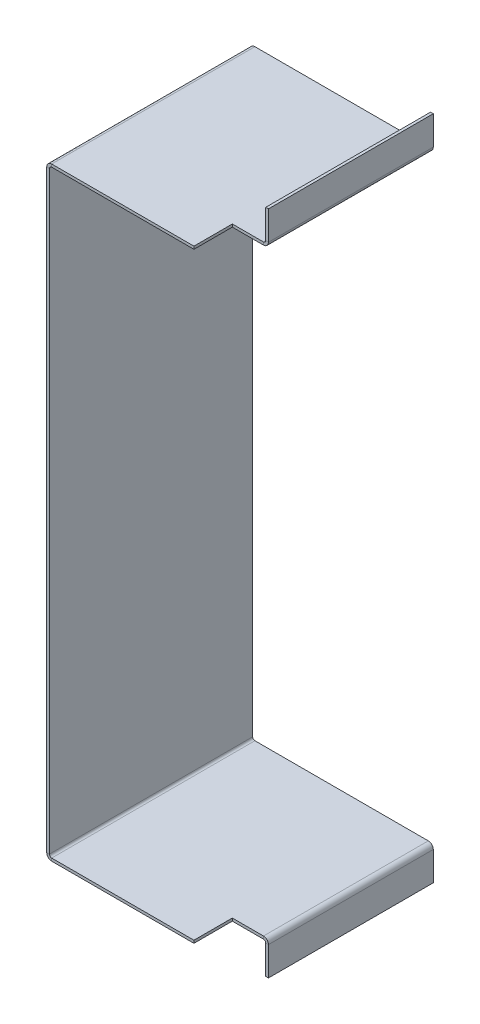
ISO-10303-21;
HEADER;
FILE_DESCRIPTION(('STEP AP214'),'2;1');
FILE_NAME('part.step','',(''),(''),'','','');
FILE_SCHEMA(('AUTOMOTIVE_DESIGN { 1 0 10303 214 1 1 1 1 }'));
ENDSEC;
DATA;
#1=APPLICATION_CONTEXT('core data for automotive mechanical design processes');
#2=APPLICATION_PROTOCOL_DEFINITION('international standard','automotive_design',2000,#1);
#3=PRODUCT_CONTEXT('',#1,'mechanical');
#4=PRODUCT('Part','Part','',(#3));
#5=PRODUCT_RELATED_PRODUCT_CATEGORY('part','',(#4));
#6=PRODUCT_DEFINITION_FORMATION('','',#4);
#7=PRODUCT_DEFINITION_CONTEXT('part definition',#1,'design');
#8=PRODUCT_DEFINITION('design','',#6,#7);
#9=PRODUCT_DEFINITION_SHAPE('','',#8);
#10=(LENGTH_UNIT() NAMED_UNIT(*) SI_UNIT(.MILLI.,.METRE.));
#11=(NAMED_UNIT(*) PLANE_ANGLE_UNIT() SI_UNIT($,.RADIAN.));
#12=(NAMED_UNIT(*) SI_UNIT($,.STERADIAN.) SOLID_ANGLE_UNIT());
#13=UNCERTAINTY_MEASURE_WITH_UNIT(LENGTH_MEASURE(1.E-05),#10,'distance_accuracy_value','');
#14=(GEOMETRIC_REPRESENTATION_CONTEXT(3) GLOBAL_UNCERTAINTY_ASSIGNED_CONTEXT((#13)) GLOBAL_UNIT_ASSIGNED_CONTEXT((#10,
#11,#12)) REPRESENTATION_CONTEXT('',''));
#15=CARTESIAN_POINT('',(0.,0.,0.));
#16=DIRECTION('',(0.,0.,1.));
#17=DIRECTION('',(1.,0.,0.));
#18=AXIS2_PLACEMENT_3D('',#15,#16,#17);
#19=CARTESIAN_POINT('',(0.,-295.,72.9999999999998));
#20=DIRECTION('',(0.,0.,-1.));
#21=DIRECTION('',(-1.,0.,0.));
#22=AXIS2_PLACEMENT_3D('',#19,#20,#21);
#23=PLANE('',#22);
#24=DIRECTION('',(0.,1.,0.));
#25=VECTOR('',#24,1.);
#26=CARTESIAN_POINT('',(-1.19999999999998,0.,73.));
#27=LINE('',#26,#25);
#28=CARTESIAN_POINT('',(-1.19999999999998,-12.7999999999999,72.9999999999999));
#29=VERTEX_POINT('',#28);
#30=CARTESIAN_POINT('',(-1.19999999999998,0.,73.));
#31=VERTEX_POINT('',#30);
#32=EDGE_CURVE('E259',#29,#31,#27,.T.);
#33=ORIENTED_EDGE('',*,*,#32,.F.);
#34=DIRECTION('',(1.,0.,0.));
#35=VECTOR('',#34,1.);
#36=CARTESIAN_POINT('',(-1.19999999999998,-12.7999999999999,72.9999999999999));
#37=LINE('',#36,#35);
#38=CARTESIAN_POINT('',(0.,-12.7999999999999,72.9999999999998));
#39=VERTEX_POINT('',#38);
#40=EDGE_CURVE('E11',#29,#39,#37,.T.);
#41=ORIENTED_EDGE('',*,*,#40,.T.);
#42=DIRECTION('',(0.,1.,0.));
#43=VECTOR('',#42,1.);
#44=CARTESIAN_POINT('',(0.,-295.,72.9999999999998));
#45=LINE('',#44,#43);
#46=CARTESIAN_POINT('',(0.,0.,72.9999999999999));
#47=VERTEX_POINT('',#46);
#48=EDGE_CURVE('E211',#39,#47,#45,.T.);
#49=ORIENTED_EDGE('',*,*,#48,.T.);
#50=DIRECTION('',(-1.,0.,0.));
#51=VECTOR('',#50,1.);
#52=CARTESIAN_POINT('',(0.,0.,72.9999999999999));
#53=LINE('',#52,#51);
#54=EDGE_CURVE('E222',#47,#31,#53,.T.);
#55=ORIENTED_EDGE('',*,*,#54,.T.);
#56=EDGE_LOOP('',(#33,#41,#49,#55));
#57=FACE_BOUND('',#56,.T.);
#58=ADVANCED_FACE('F44',(#57),#23,.F.);
#59=DIRECTION('',(1.,0.,0.));
#60=VECTOR('',#59,1.);
#61=CARTESIAN_POINT('',(0.,-15.,72.9999999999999));
#62=LINE('',#61,#60);
#63=CARTESIAN_POINT('',(-16.,-15.,73.));
#64=VERTEX_POINT('',#63);
#65=CARTESIAN_POINT('',(-2.19999999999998,-15.,73.));
#66=VERTEX_POINT('',#65);
#67=EDGE_CURVE('E265',#64,#66,#62,.T.);
#68=ORIENTED_EDGE('',*,*,#67,.T.);
#69=DIRECTION('',(0.,1.,0.));
#70=VECTOR('',#69,1.);
#71=CARTESIAN_POINT('',(-2.19999999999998,-15.,73.));
#72=LINE('',#71,#70);
#73=CARTESIAN_POINT('',(-2.19999999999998,-13.7999999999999,73.));
#74=VERTEX_POINT('',#73);
#75=EDGE_CURVE('E53',#66,#74,#72,.T.);
#76=ORIENTED_EDGE('',*,*,#75,.T.);
#77=DIRECTION('',(1.,0.,0.));
#78=VECTOR('',#77,1.);
#79=CARTESIAN_POINT('',(0.,-13.7999999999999,72.9999999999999));
#80=LINE('',#79,#78);
#81=CARTESIAN_POINT('',(-16.,-13.7999999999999,73.));
#82=VERTEX_POINT('',#81);
#83=EDGE_CURVE('E253',#82,#74,#80,.T.);
#84=ORIENTED_EDGE('',*,*,#83,.F.);
#85=DIRECTION('',(0.,1.,0.));
#86=VECTOR('',#85,1.);
#87=CARTESIAN_POINT('',(-16.,-295.,72.9999999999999));
#88=LINE('',#87,#86);
#89=EDGE_CURVE('E237',#64,#82,#88,.T.);
#90=ORIENTED_EDGE('',*,*,#89,.F.);
#91=EDGE_LOOP('',(#68,#76,#84,#90));
#92=FACE_BOUND('',#91,.T.);
#93=ADVANCED_FACE('F524',(#92),#23,.F.);
#94=DIRECTION('',(-1.,0.,0.));
#95=VECTOR('',#94,1.);
#96=CARTESIAN_POINT('',(-80.,-281.2,72.9999999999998));
#97=LINE('',#96,#95);
#98=CARTESIAN_POINT('',(-2.19999999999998,-281.2,73.));
#99=VERTEX_POINT('',#98);
#100=CARTESIAN_POINT('',(-16.,-281.2,72.9999999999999));
#101=VERTEX_POINT('',#100);
#102=EDGE_CURVE('E244',#99,#101,#97,.T.);
#103=ORIENTED_EDGE('',*,*,#102,.F.);
#104=DIRECTION('',(0.,1.,0.));
#105=VECTOR('',#104,1.);
#106=CARTESIAN_POINT('',(-2.19999999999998,-281.2,73.));
#107=LINE('',#106,#105);
#108=CARTESIAN_POINT('',(-2.19999999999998,-280.,73.));
#109=VERTEX_POINT('',#108);
#110=EDGE_CURVE('E516',#99,#109,#107,.T.);
#111=ORIENTED_EDGE('',*,*,#110,.T.);
#112=DIRECTION('',(-1.,0.,0.));
#113=VECTOR('',#112,1.);
#114=CARTESIAN_POINT('',(-80.,-280.,73.));
#115=LINE('',#114,#113);
#116=CARTESIAN_POINT('',(-16.,-280.,72.9999999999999));
#117=VERTEX_POINT('',#116);
#118=EDGE_CURVE('E269',#109,#117,#115,.T.);
#119=ORIENTED_EDGE('',*,*,#118,.T.);
#120=EDGE_CURVE('E561',#101,#117,#88,.T.);
#121=ORIENTED_EDGE('',*,*,#120,.F.);
#122=EDGE_LOOP('',(#103,#111,#119,#121));
#123=FACE_BOUND('',#122,.T.);
#124=ADVANCED_FACE('F606',(#123),#23,.F.);
#125=CARTESIAN_POINT('',(0.,-295.,72.9999999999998));
#126=VERTEX_POINT('',#125);
#127=CARTESIAN_POINT('',(0.,-282.2,72.9999999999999));
#128=VERTEX_POINT('',#127);
#129=EDGE_CURVE('E231',#126,#128,#45,.T.);
#130=ORIENTED_EDGE('',*,*,#129,.T.);
#131=DIRECTION('',(-1.,0.,0.));
#132=VECTOR('',#131,1.);
#133=CARTESIAN_POINT('',(0.,-282.2,72.9999999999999));
#134=LINE('',#133,#132);
#135=CARTESIAN_POINT('',(-1.19999999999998,-282.2,73.));
#136=VERTEX_POINT('',#135);
#137=EDGE_CURVE('E512',#128,#136,#134,.T.);
#138=ORIENTED_EDGE('',*,*,#137,.T.);
#139=DIRECTION('',(0.,1.,0.));
#140=VECTOR('',#139,1.);
#141=CARTESIAN_POINT('',(-1.19999999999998,-280.,72.9999999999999));
#142=LINE('',#141,#140);
#143=CARTESIAN_POINT('',(-1.19999999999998,-295.,72.9999999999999));
#144=VERTEX_POINT('',#143);
#145=EDGE_CURVE('E248',#144,#136,#142,.T.);
#146=ORIENTED_EDGE('',*,*,#145,.F.);
#147=DIRECTION('',(-1.,0.,0.));
#148=VECTOR('',#147,1.);
#149=CARTESIAN_POINT('',(0.,-295.,72.9999999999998));
#150=LINE('',#149,#148);
#151=EDGE_CURVE('E228',#126,#144,#150,.T.);
#152=ORIENTED_EDGE('',*,*,#151,.F.);
#153=EDGE_LOOP('',(#130,#138,#146,#152));
#154=FACE_BOUND('',#153,.T.);
#155=ADVANCED_FACE('F626',(#154),#23,.F.);
#156=CARTESIAN_POINT('',(-1.19999999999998,-12.7999999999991,89.9999999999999));
#157=DIRECTION('',(0.,0.,1.));
#158=DIRECTION('',(1.,0.,0.));
#159=AXIS2_PLACEMENT_3D('',#156,#157,#158);
#160=PLANE('',#159);
#161=DIRECTION('',(0.,1.,0.));
#162=VECTOR('',#161,1.);
#163=CARTESIAN_POINT('',(-16.,-295.,89.9999999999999));
#164=LINE('',#163,#162);
#165=CARTESIAN_POINT('',(-16.,-14.9999999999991,90.));
#166=VERTEX_POINT('',#165);
#167=CARTESIAN_POINT('',(-16.,-13.7999999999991,90.));
#168=VERTEX_POINT('',#167);
#169=EDGE_CURVE('E565',#166,#168,#164,.T.);
#170=ORIENTED_EDGE('',*,*,#169,.T.);
#171=DIRECTION('',(-1.,0.,0.));
#172=VECTOR('',#171,1.);
#173=CARTESIAN_POINT('',(0.,-13.7999999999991,89.9999999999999));
#174=LINE('',#173,#172);
#175=CARTESIAN_POINT('',(-79.,-13.7999999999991,90.));
#176=VERTEX_POINT('',#175);
#177=EDGE_CURVE('E308',#168,#176,#174,.T.);
#178=ORIENTED_EDGE('',*,*,#177,.T.);
#179=DIRECTION('',(0.,-1.,0.));
#180=VECTOR('',#179,1.);
#181=CARTESIAN_POINT('',(-79.,-13.7999999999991,90.));
#182=LINE('',#181,#180);
#183=CARTESIAN_POINT('',(-79.,-14.9999999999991,90.));
#184=VERTEX_POINT('',#183);
#185=EDGE_CURVE('E491',#176,#184,#182,.T.);
#186=ORIENTED_EDGE('',*,*,#185,.T.);
#187=DIRECTION('',(-1.,0.,0.));
#188=VECTOR('',#187,1.);
#189=CARTESIAN_POINT('',(0.,-14.9999999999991,89.9999999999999));
#190=LINE('',#189,#188);
#191=EDGE_CURVE('E304',#166,#184,#190,.T.);
#192=ORIENTED_EDGE('',*,*,#191,.F.);
#193=EDGE_LOOP('',(#170,#178,#186,#192));
#194=FACE_BOUND('',#193,.T.);
#195=ADVANCED_FACE('F46',(#194),#160,.T.);
#196=CARTESIAN_POINT('',(0.,-12.8,0.));
#197=DIRECTION('',(0.,0.,-1.));
#198=DIRECTION('',(-1.,0.,0.));
#199=AXIS2_PLACEMENT_3D('',#196,#197,#198);
#200=PLANE('',#199);
#201=DIRECTION('',(-1.,0.,0.));
#202=VECTOR('',#201,1.);
#203=CARTESIAN_POINT('',(0.,-12.8,0.));
#204=LINE('',#203,#202);
#205=CARTESIAN_POINT('',(0.,-12.8,0.));
#206=VERTEX_POINT('',#205);
#207=CARTESIAN_POINT('',(-1.19999999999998,-12.8,0.));
#208=VERTEX_POINT('',#207);
#209=EDGE_CURVE('E503',#206,#208,#204,.T.);
#210=ORIENTED_EDGE('',*,*,#209,.F.);
#211=CARTESIAN_POINT('',(-2.19999999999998,-12.8,0.));
#212=DIRECTION('',(0.,0.,1.));
#213=DIRECTION('',(1.,0.,0.));
#214=AXIS2_PLACEMENT_3D('',#211,#212,#213);
#215=CIRCLE('',#214,2.2);
#216=CARTESIAN_POINT('',(-2.19999999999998,-15.,0.));
#217=VERTEX_POINT('',#216);
#218=EDGE_CURVE('E362',#206,#217,#215,.F.);
#219=ORIENTED_EDGE('',*,*,#218,.T.);
#220=DIRECTION('',(0.,-1.,0.));
#221=VECTOR('',#220,1.);
#222=CARTESIAN_POINT('',(-2.19999999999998,-13.8,0.));
#223=LINE('',#222,#221);
#224=CARTESIAN_POINT('',(-2.19999999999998,-13.8,0.));
#225=VERTEX_POINT('',#224);
#226=EDGE_CURVE('E499',#225,#217,#223,.T.);
#227=ORIENTED_EDGE('',*,*,#226,.F.);
#228=CARTESIAN_POINT('',(-2.19999999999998,-12.8,0.));
#229=DIRECTION('',(0.,0.,1.));
#230=DIRECTION('',(1.,0.,0.));
#231=AXIS2_PLACEMENT_3D('',#228,#229,#230);
#232=CIRCLE('',#231,1.);
#233=EDGE_CURVE('E375',#208,#225,#232,.F.);
#234=ORIENTED_EDGE('',*,*,#233,.F.);
#235=EDGE_LOOP('',(#210,#219,#227,#234));
#236=FACE_BOUND('',#235,.T.);
#237=ADVANCED_FACE('F543',(#236),#200,.T.);
#238=CARTESIAN_POINT('',(-2.19999999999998,-13.8,0.));
#239=DIRECTION('',(0.,0.,-1.));
#240=DIRECTION('',(-1.,0.,0.));
#241=AXIS2_PLACEMENT_3D('',#238,#239,#240);
#242=PLANE('',#241);
#243=DIRECTION('',(0.,-1.,0.));
#244=VECTOR('',#243,1.);
#245=CARTESIAN_POINT('',(0.,0.,0.));
#246=LINE('',#245,#244);
#247=CARTESIAN_POINT('',(0.,0.,0.));
#248=VERTEX_POINT('',#247);
#249=EDGE_CURVE('E213',#248,#206,#246,.T.);
#250=ORIENTED_EDGE('',*,*,#249,.T.);
#251=ORIENTED_EDGE('',*,*,#209,.T.);
#252=DIRECTION('',(0.,-1.,0.));
#253=VECTOR('',#252,1.);
#254=CARTESIAN_POINT('',(-1.19999999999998,0.,0.));
#255=LINE('',#254,#253);
#256=CARTESIAN_POINT('',(-1.19999999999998,0.,0.));
#257=VERTEX_POINT('',#256);
#258=EDGE_CURVE('E371',#257,#208,#255,.T.);
#259=ORIENTED_EDGE('',*,*,#258,.F.);
#260=DIRECTION('',(1.,0.,0.));
#261=VECTOR('',#260,1.);
#262=CARTESIAN_POINT('',(-1.19999999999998,0.,0.));
#263=LINE('',#262,#261);
#264=EDGE_CURVE('E368',#257,#248,#263,.T.);
#265=ORIENTED_EDGE('',*,*,#264,.T.);
#266=EDGE_LOOP('',(#250,#251,#259,#265));
#267=FACE_BOUND('',#266,.T.);
#268=ADVANCED_FACE('F546',(#267),#242,.T.);
#269=CARTESIAN_POINT('',(-80.,-15.9999999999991,89.9999999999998));
#270=DIRECTION('',(0.,0.,1.));
#271=DIRECTION('',(1.,0.,0.));
#272=AXIS2_PLACEMENT_3D('',#269,#270,#271);
#273=PLANE('',#272);
#274=DIRECTION('',(-1.,0.,0.));
#275=VECTOR('',#274,1.);
#276=CARTESIAN_POINT('',(-80.,-15.9999999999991,89.9999999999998));
#277=LINE('',#276,#275);
#278=CARTESIAN_POINT('',(-80.,-15.9999999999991,89.9999999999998));
#279=VERTEX_POINT('',#278);
#280=CARTESIAN_POINT('',(-81.2,-15.9999999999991,89.9999999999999));
#281=VERTEX_POINT('',#280);
#282=EDGE_CURVE('E495',#279,#281,#277,.T.);
#283=ORIENTED_EDGE('',*,*,#282,.F.);
#284=CARTESIAN_POINT('',(-79.,-15.9999999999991,90.));
#285=DIRECTION('',(0.,0.,-1.));
#286=DIRECTION('',(-1.,0.,0.));
#287=AXIS2_PLACEMENT_3D('',#284,#285,#286);
#288=CIRCLE('',#287,1.);
#289=EDGE_CURVE('E300',#184,#279,#288,.F.);
#290=ORIENTED_EDGE('',*,*,#289,.F.);
#291=ORIENTED_EDGE('',*,*,#185,.F.);
#292=CARTESIAN_POINT('',(-79.,-15.9999999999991,90.));
#293=DIRECTION('',(0.,0.,1.));
#294=DIRECTION('',(1.,0.,0.));
#295=AXIS2_PLACEMENT_3D('',#292,#293,#294);
#296=CIRCLE('',#295,2.2);
#297=EDGE_CURVE('E312',#176,#281,#296,.T.);
#298=ORIENTED_EDGE('',*,*,#297,.T.);
#299=EDGE_LOOP('',(#283,#290,#291,#298));
#300=FACE_BOUND('',#299,.T.);
#301=ADVANCED_FACE('F943',(#300),#273,.T.);
#302=CARTESIAN_POINT('',(-79.,-13.7999999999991,90.));
#303=DIRECTION('',(0.,0.,1.));
#304=DIRECTION('',(1.,0.,0.));
#305=AXIS2_PLACEMENT_3D('',#302,#303,#304);
#306=PLANE('',#305);
#307=DIRECTION('',(0.,-1.,0.));
#308=VECTOR('',#307,1.);
#309=CARTESIAN_POINT('',(-80.,-14.9999999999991,89.9999999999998));
#310=LINE('',#309,#308);
#311=CARTESIAN_POINT('',(-80.,-279.,90.));
#312=VERTEX_POINT('',#311);
#313=EDGE_CURVE('E296',#279,#312,#310,.T.);
#314=ORIENTED_EDGE('',*,*,#313,.F.);
#315=ORIENTED_EDGE('',*,*,#282,.T.);
#316=DIRECTION('',(0.,-1.,0.));
#317=VECTOR('',#316,1.);
#318=CARTESIAN_POINT('',(-81.2,-14.9999999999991,89.9999999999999));
#319=LINE('',#318,#317);
#320=CARTESIAN_POINT('',(-81.2,-279.,89.9999999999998));
#321=VERTEX_POINT('',#320);
#322=EDGE_CURVE('E316',#281,#321,#319,.T.);
#323=ORIENTED_EDGE('',*,*,#322,.T.);
#324=DIRECTION('',(1.,0.,0.));
#325=VECTOR('',#324,1.);
#326=CARTESIAN_POINT('',(-81.2,-279.,89.9999999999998));
#327=LINE('',#326,#325);
#328=EDGE_CURVE('E475',#321,#312,#327,.T.);
#329=ORIENTED_EDGE('',*,*,#328,.T.);
#330=EDGE_LOOP('',(#314,#315,#323,#329));
#331=FACE_BOUND('',#330,.T.);
#332=ADVANCED_FACE('F934',(#331),#306,.T.);
#333=CARTESIAN_POINT('',(-79.,-15.,0.));
#334=DIRECTION('',(0.,0.,-1.));
#335=DIRECTION('',(-1.,0.,0.));
#336=AXIS2_PLACEMENT_3D('',#333,#334,#335);
#337=PLANE('',#336);
#338=DIRECTION('',(0.,1.,0.));
#339=VECTOR('',#338,1.);
#340=CARTESIAN_POINT('',(-79.,-15.,0.));
#341=LINE('',#340,#339);
#342=CARTESIAN_POINT('',(-79.,-15.,0.));
#343=VERTEX_POINT('',#342);
#344=CARTESIAN_POINT('',(-79.,-13.8,0.));
#345=VERTEX_POINT('',#344);
#346=EDGE_CURVE('E487',#343,#345,#341,.T.);
#347=ORIENTED_EDGE('',*,*,#346,.F.);
#348=CARTESIAN_POINT('',(-79.,-16.,0.));
#349=DIRECTION('',(0.,0.,-1.));
#350=DIRECTION('',(-1.,0.,0.));
#351=AXIS2_PLACEMENT_3D('',#348,#349,#350);
#352=CIRCLE('',#351,1.);
#353=CARTESIAN_POINT('',(-80.,-16.,0.));
#354=VERTEX_POINT('',#353);
#355=EDGE_CURVE('E354',#343,#354,#352,.F.);
#356=ORIENTED_EDGE('',*,*,#355,.T.);
#357=DIRECTION('',(1.,0.,0.));
#358=VECTOR('',#357,1.);
#359=CARTESIAN_POINT('',(-81.2,-16.,0.));
#360=LINE('',#359,#358);
#361=CARTESIAN_POINT('',(-81.2,-16.,0.));
#362=VERTEX_POINT('',#361);
#363=EDGE_CURVE('E483',#362,#354,#360,.T.);
#364=ORIENTED_EDGE('',*,*,#363,.F.);
#365=CARTESIAN_POINT('',(-79.,-16.,0.));
#366=DIRECTION('',(0.,0.,1.));
#367=DIRECTION('',(1.,0.,0.));
#368=AXIS2_PLACEMENT_3D('',#365,#366,#367);
#369=CIRCLE('',#368,2.2);
#370=EDGE_CURVE('E383',#345,#362,#369,.T.);
#371=ORIENTED_EDGE('',*,*,#370,.F.);
#372=EDGE_LOOP('',(#347,#356,#364,#371));
#373=FACE_BOUND('',#372,.T.);
#374=ADVANCED_FACE('F928',(#373),#337,.T.);
#375=CARTESIAN_POINT('',(-81.2,-16.,0.));
#376=DIRECTION('',(0.,0.,-1.));
#377=DIRECTION('',(-1.,0.,0.));
#378=AXIS2_PLACEMENT_3D('',#375,#376,#377);
#379=PLANE('',#378);
#380=DIRECTION('',(-1.,0.,0.));
#381=VECTOR('',#380,1.);
#382=CARTESIAN_POINT('',(0.,-15.,0.));
#383=LINE('',#382,#381);
#384=EDGE_CURVE('E358',#217,#343,#383,.T.);
#385=ORIENTED_EDGE('',*,*,#384,.T.);
#386=ORIENTED_EDGE('',*,*,#346,.T.);
#387=DIRECTION('',(-1.,0.,0.));
#388=VECTOR('',#387,1.);
#389=CARTESIAN_POINT('',(0.,-13.8,0.));
#390=LINE('',#389,#388);
#391=EDGE_CURVE('E379',#225,#345,#390,.T.);
#392=ORIENTED_EDGE('',*,*,#391,.F.);
#393=ORIENTED_EDGE('',*,*,#226,.T.);
#394=EDGE_LOOP('',(#385,#386,#392,#393));
#395=FACE_BOUND('',#394,.T.);
#396=ADVANCED_FACE('F539',(#395),#379,.T.);
#397=CARTESIAN_POINT('',(-79.,-280.,90.));
#398=DIRECTION('',(0.,0.,1.));
#399=DIRECTION('',(1.,0.,0.));
#400=AXIS2_PLACEMENT_3D('',#397,#398,#399);
#401=PLANE('',#400);
#402=DIRECTION('',(0.,-1.,0.));
#403=VECTOR('',#402,1.);
#404=CARTESIAN_POINT('',(-79.,-280.,90.));
#405=LINE('',#404,#403);
#406=CARTESIAN_POINT('',(-79.,-280.,90.));
#407=VERTEX_POINT('',#406);
#408=CARTESIAN_POINT('',(-79.,-281.2,90.));
#409=VERTEX_POINT('',#408);
#410=EDGE_CURVE('E479',#407,#409,#405,.T.);
#411=ORIENTED_EDGE('',*,*,#410,.F.);
#412=CARTESIAN_POINT('',(-79.,-279.,89.9999999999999));
#413=DIRECTION('',(0.,0.,-1.));
#414=DIRECTION('',(-1.,0.,0.));
#415=AXIS2_PLACEMENT_3D('',#412,#413,#414);
#416=CIRCLE('',#415,1.);
#417=EDGE_CURVE('E291',#312,#407,#416,.F.);
#418=ORIENTED_EDGE('',*,*,#417,.F.);
#419=ORIENTED_EDGE('',*,*,#328,.F.);
#420=CARTESIAN_POINT('',(-79.,-279.,89.9999999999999));
#421=DIRECTION('',(0.,0.,1.));
#422=DIRECTION('',(1.,0.,0.));
#423=AXIS2_PLACEMENT_3D('',#420,#421,#422);
#424=CIRCLE('',#423,2.2);
#425=EDGE_CURVE('E320',#321,#409,#424,.T.);
#426=ORIENTED_EDGE('',*,*,#425,.T.);
#427=EDGE_LOOP('',(#411,#418,#419,#426));
#428=FACE_BOUND('',#427,.T.);
#429=ADVANCED_FACE('F594',(#428),#401,.T.);
#430=CARTESIAN_POINT('',(-81.2,-279.,89.9999999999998));
#431=DIRECTION('',(0.,0.,1.));
#432=DIRECTION('',(1.,0.,0.));
#433=AXIS2_PLACEMENT_3D('',#430,#431,#432);
#434=PLANE('',#433);
#435=CARTESIAN_POINT('',(-16.,-281.2,89.9999999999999));
#436=VERTEX_POINT('',#435);
#437=CARTESIAN_POINT('',(-16.,-280.,89.9999999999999));
#438=VERTEX_POINT('',#437);
#439=EDGE_CURVE('E249',#436,#438,#164,.T.);
#440=ORIENTED_EDGE('',*,*,#439,.T.);
#441=DIRECTION('',(1.,0.,0.));
#442=VECTOR('',#441,1.);
#443=CARTESIAN_POINT('',(-80.,-280.,90.));
#444=LINE('',#443,#442);
#445=EDGE_CURVE('E287',#407,#438,#444,.T.);
#446=ORIENTED_EDGE('',*,*,#445,.F.);
#447=ORIENTED_EDGE('',*,*,#410,.T.);
#448=DIRECTION('',(1.,0.,0.));
#449=VECTOR('',#448,1.);
#450=CARTESIAN_POINT('',(-80.,-281.2,89.9999999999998));
#451=LINE('',#450,#449);
#452=EDGE_CURVE('E324',#409,#436,#451,.T.);
#453=ORIENTED_EDGE('',*,*,#452,.T.);
#454=EDGE_LOOP('',(#440,#446,#447,#453));
#455=FACE_BOUND('',#454,.T.);
#456=ADVANCED_FACE('F579',(#455),#434,.T.);
#457=CARTESIAN_POINT('',(-80.,-279.,0.));
#458=DIRECTION('',(0.,0.,-1.));
#459=DIRECTION('',(-1.,0.,0.));
#460=AXIS2_PLACEMENT_3D('',#457,#458,#459);
#461=PLANE('',#460);
#462=DIRECTION('',(-1.,0.,0.));
#463=VECTOR('',#462,1.);
#464=CARTESIAN_POINT('',(-80.,-279.,0.));
#465=LINE('',#464,#463);
#466=CARTESIAN_POINT('',(-80.,-279.,0.));
#467=VERTEX_POINT('',#466);
#468=CARTESIAN_POINT('',(-81.2,-279.,0.));
#469=VERTEX_POINT('',#468);
#470=EDGE_CURVE('E471',#467,#469,#465,.T.);
#471=ORIENTED_EDGE('',*,*,#470,.F.);
#472=CARTESIAN_POINT('',(-79.,-279.,0.));
#473=DIRECTION('',(0.,0.,-1.));
#474=DIRECTION('',(-1.,0.,0.));
#475=AXIS2_PLACEMENT_3D('',#472,#473,#474);
#476=CIRCLE('',#475,1.);
#477=CARTESIAN_POINT('',(-79.,-280.,0.));
#478=VERTEX_POINT('',#477);
#479=EDGE_CURVE('E346',#467,#478,#476,.F.);
#480=ORIENTED_EDGE('',*,*,#479,.T.);
#481=DIRECTION('',(0.,1.,0.));
#482=VECTOR('',#481,1.);
#483=CARTESIAN_POINT('',(-79.,-281.2,0.));
#484=LINE('',#483,#482);
#485=CARTESIAN_POINT('',(-79.,-281.2,0.));
#486=VERTEX_POINT('',#485);
#487=EDGE_CURVE('E467',#486,#478,#484,.T.);
#488=ORIENTED_EDGE('',*,*,#487,.F.);
#489=CARTESIAN_POINT('',(-79.,-279.,0.));
#490=DIRECTION('',(0.,0.,1.));
#491=DIRECTION('',(1.,0.,0.));
#492=AXIS2_PLACEMENT_3D('',#489,#490,#491);
#493=CIRCLE('',#492,2.2);
#494=EDGE_CURVE('E391',#469,#486,#493,.T.);
#495=ORIENTED_EDGE('',*,*,#494,.F.);
#496=EDGE_LOOP('',(#471,#480,#488,#495));
#497=FACE_BOUND('',#496,.T.);
#498=ADVANCED_FACE('F902',(#497),#461,.T.);
#499=CARTESIAN_POINT('',(-79.,-281.2,0.));
#500=DIRECTION('',(0.,0.,-1.));
#501=DIRECTION('',(-1.,0.,0.));
#502=AXIS2_PLACEMENT_3D('',#499,#500,#501);
#503=PLANE('',#502);
#504=DIRECTION('',(0.,-1.,0.));
#505=VECTOR('',#504,1.);
#506=CARTESIAN_POINT('',(-80.,-15.,0.));
#507=LINE('',#506,#505);
#508=EDGE_CURVE('E350',#354,#467,#507,.T.);
#509=ORIENTED_EDGE('',*,*,#508,.T.);
#510=ORIENTED_EDGE('',*,*,#470,.T.);
#511=DIRECTION('',(0.,-1.,0.));
#512=VECTOR('',#511,1.);
#513=CARTESIAN_POINT('',(-81.2,-15.,0.));
#514=LINE('',#513,#512);
#515=EDGE_CURVE('E387',#362,#469,#514,.T.);
#516=ORIENTED_EDGE('',*,*,#515,.F.);
#517=ORIENTED_EDGE('',*,*,#363,.T.);
#518=EDGE_LOOP('',(#509,#510,#516,#517));
#519=FACE_BOUND('',#518,.T.);
#520=ADVANCED_FACE('F894',(#519),#503,.T.);
#521=CARTESIAN_POINT('',(-2.19999999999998,-280.,0.));
#522=DIRECTION('',(0.,0.,-1.));
#523=DIRECTION('',(-1.,0.,0.));
#524=AXIS2_PLACEMENT_3D('',#521,#522,#523);
#525=PLANE('',#524);
#526=DIRECTION('',(0.,-1.,0.));
#527=VECTOR('',#526,1.);
#528=CARTESIAN_POINT('',(-2.19999999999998,-280.,0.));
#529=LINE('',#528,#527);
#530=CARTESIAN_POINT('',(-2.19999999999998,-280.,0.));
#531=VERTEX_POINT('',#530);
#532=CARTESIAN_POINT('',(-2.19999999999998,-281.2,0.));
#533=VERTEX_POINT('',#532);
#534=EDGE_CURVE('E463',#531,#533,#529,.T.);
#535=ORIENTED_EDGE('',*,*,#534,.F.);
#536=CARTESIAN_POINT('',(-2.19999999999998,-282.2,0.));
#537=DIRECTION('',(0.,0.,1.));
#538=DIRECTION('',(1.,0.,0.));
#539=AXIS2_PLACEMENT_3D('',#536,#537,#538);
#540=CIRCLE('',#539,2.2);
#541=CARTESIAN_POINT('',(0.,-282.2,0.));
#542=VERTEX_POINT('',#541);
#543=EDGE_CURVE('E338',#531,#542,#540,.F.);
#544=ORIENTED_EDGE('',*,*,#543,.T.);
#545=DIRECTION('',(1.,0.,0.));
#546=VECTOR('',#545,1.);
#547=CARTESIAN_POINT('',(-1.19999999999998,-282.2,0.));
#548=LINE('',#547,#546);
#549=CARTESIAN_POINT('',(-1.19999999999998,-282.2,0.));
#550=VERTEX_POINT('',#549);
#551=EDGE_CURVE('E459',#550,#542,#548,.T.);
#552=ORIENTED_EDGE('',*,*,#551,.F.);
#553=CARTESIAN_POINT('',(-2.19999999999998,-282.2,0.));
#554=DIRECTION('',(0.,0.,1.));
#555=DIRECTION('',(1.,0.,0.));
#556=AXIS2_PLACEMENT_3D('',#553,#554,#555);
#557=CIRCLE('',#556,1.);
#558=EDGE_CURVE('E292',#533,#550,#557,.F.);
#559=ORIENTED_EDGE('',*,*,#558,.F.);
#560=EDGE_LOOP('',(#535,#544,#552,#559));
#561=FACE_BOUND('',#560,.T.);
#562=ADVANCED_FACE('F618',(#561),#525,.T.);
#563=CARTESIAN_POINT('',(-1.19999999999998,-282.2,0.));
#564=DIRECTION('',(0.,0.,-1.));
#565=DIRECTION('',(-1.,0.,0.));
#566=AXIS2_PLACEMENT_3D('',#563,#564,#565);
#567=PLANE('',#566);
#568=DIRECTION('',(1.,0.,0.));
#569=VECTOR('',#568,1.);
#570=CARTESIAN_POINT('',(-80.,-280.,0.));
#571=LINE('',#570,#569);
#572=EDGE_CURVE('E342',#478,#531,#571,.T.);
#573=ORIENTED_EDGE('',*,*,#572,.T.);
#574=ORIENTED_EDGE('',*,*,#534,.T.);
#575=DIRECTION('',(1.,0.,0.));
#576=VECTOR('',#575,1.);
#577=CARTESIAN_POINT('',(-80.,-281.2,0.));
#578=LINE('',#577,#576);
#579=EDGE_CURVE('E395',#486,#533,#578,.T.);
#580=ORIENTED_EDGE('',*,*,#579,.F.);
#581=ORIENTED_EDGE('',*,*,#487,.T.);
#582=EDGE_LOOP('',(#573,#574,#580,#581));
#583=FACE_BOUND('',#582,.T.);
#584=ADVANCED_FACE('F610',(#583),#567,.T.);
#585=CARTESIAN_POINT('',(-1.19999999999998,-280.,89.9999999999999));
#586=DIRECTION('',(1.,0.,0.));
#587=DIRECTION('',(0.,1.,0.));
#588=AXIS2_PLACEMENT_3D('',#585,#586,#587);
#589=PLANE('',#588);
#590=DIRECTION('',(0.,0.,-1.));
#591=VECTOR('',#590,1.);
#592=CARTESIAN_POINT('',(-1.19999999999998,-295.,89.9999999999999));
#593=LINE('',#592,#591);
#594=CARTESIAN_POINT('',(-1.19999999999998,-295.,0.));
#595=VERTEX_POINT('',#594);
#596=EDGE_CURVE('E455',#144,#595,#593,.T.);
#597=ORIENTED_EDGE('',*,*,#596,.F.);
#598=ORIENTED_EDGE('',*,*,#145,.T.);
#599=DIRECTION('',(0.,0.,-1.));
#600=VECTOR('',#599,1.);
#601=CARTESIAN_POINT('',(-1.19999999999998,-282.2,90.));
#602=LINE('',#601,#600);
#603=EDGE_CURVE('E328',#136,#550,#602,.T.);
#604=ORIENTED_EDGE('',*,*,#603,.T.);
#605=DIRECTION('',(0.,-1.,0.));
#606=VECTOR('',#605,1.);
#607=CARTESIAN_POINT('',(-1.19999999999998,-280.,0.));
#608=LINE('',#607,#606);
#609=EDGE_CURVE('E286',#550,#595,#608,.T.);
#610=ORIENTED_EDGE('',*,*,#609,.T.);
#611=EDGE_LOOP('',(#597,#598,#604,#610));
#612=FACE_BOUND('',#611,.T.);
#613=ADVANCED_FACE('F622',(#612),#589,.F.);
#614=CARTESIAN_POINT('',(0.,-295.,89.9999999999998));
#615=DIRECTION('',(0.,-1.,0.));
#616=DIRECTION('',(0.,0.,-1.));
#617=AXIS2_PLACEMENT_3D('',#614,#615,#616);
#618=PLANE('',#617);
#619=ORIENTED_EDGE('',*,*,#151,.T.);
#620=ORIENTED_EDGE('',*,*,#596,.T.);
#621=DIRECTION('',(-1.,0.,0.));
#622=VECTOR('',#621,1.);
#623=CARTESIAN_POINT('',(0.,-295.,0.));
#624=LINE('',#623,#622);
#625=CARTESIAN_POINT('',(0.,-295.,0.));
#626=VERTEX_POINT('',#625);
#627=EDGE_CURVE('E332',#626,#595,#624,.T.);
#628=ORIENTED_EDGE('',*,*,#627,.F.);
#629=DIRECTION('',(0.,0.,-1.));
#630=VECTOR('',#629,1.);
#631=CARTESIAN_POINT('',(0.,-295.,89.9999999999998));
#632=LINE('',#631,#630);
#633=EDGE_CURVE('E451',#126,#626,#632,.T.);
#634=ORIENTED_EDGE('',*,*,#633,.F.);
#635=EDGE_LOOP('',(#619,#620,#628,#634));
#636=FACE_BOUND('',#635,.T.);
#637=ADVANCED_FACE('F636',(#636),#618,.T.);
#638=CARTESIAN_POINT('',(0.,-280.,89.9999999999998));
#639=DIRECTION('',(1.,0.,0.));
#640=DIRECTION('',(0.,1.,0.));
#641=AXIS2_PLACEMENT_3D('',#638,#639,#640);
#642=PLANE('',#641);
#643=ORIENTED_EDGE('',*,*,#129,.F.);
#644=ORIENTED_EDGE('',*,*,#633,.T.);
#645=DIRECTION('',(0.,-1.,0.));
#646=VECTOR('',#645,1.);
#647=CARTESIAN_POINT('',(0.,-280.,0.));
#648=LINE('',#647,#646);
#649=EDGE_CURVE('E335',#542,#626,#648,.T.);
#650=ORIENTED_EDGE('',*,*,#649,.F.);
#651=DIRECTION('',(0.,0.,-1.));
#652=VECTOR('',#651,1.);
#653=CARTESIAN_POINT('',(0.,-282.2,89.9999999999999));
#654=LINE('',#653,#652);
#655=EDGE_CURVE('E448',#128,#542,#654,.T.);
#656=ORIENTED_EDGE('',*,*,#655,.F.);
#657=EDGE_LOOP('',(#643,#644,#650,#656));
#658=FACE_BOUND('',#657,.T.);
#659=ADVANCED_FACE('F631',(#658),#642,.T.);
#660=CARTESIAN_POINT('',(-2.19999999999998,-282.2,90.));
#661=DIRECTION('',(0.,0.,-1.));
#662=DIRECTION('',(-1.,0.,0.));
#663=AXIS2_PLACEMENT_3D('',#660,#661,#662);
#664=CYLINDRICAL_SURFACE('',#663,2.2);
#665=CARTESIAN_POINT('',(-2.19999999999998,-282.2,73.));
#666=DIRECTION('',(0.,0.,-1.));
#667=DIRECTION('',(-1.,0.,0.));
#668=AXIS2_PLACEMENT_3D('',#665,#666,#667);
#669=CIRCLE('',#668,2.2);
#670=EDGE_CURVE('E273',#128,#109,#669,.F.);
#671=ORIENTED_EDGE('',*,*,#670,.F.);
#672=ORIENTED_EDGE('',*,*,#655,.T.);
#673=ORIENTED_EDGE('',*,*,#543,.F.);
#674=DIRECTION('',(0.,0.,-1.));
#675=VECTOR('',#674,1.);
#676=CARTESIAN_POINT('',(-2.19999999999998,-280.,90.));
#677=LINE('',#676,#675);
#678=EDGE_CURVE('E445',#109,#531,#677,.T.);
#679=ORIENTED_EDGE('',*,*,#678,.F.);
#680=EDGE_LOOP('',(#671,#672,#673,#679));
#681=FACE_BOUND('',#680,.T.);
#682=ADVANCED_FACE('F612',(#681),#664,.T.);
#683=CARTESIAN_POINT('',(-80.,-280.,90.));
#684=DIRECTION('',(0.,1.,0.));
#685=DIRECTION('',(0.,0.,1.));
#686=AXIS2_PLACEMENT_3D('',#683,#684,#685);
#687=PLANE('',#686);
#688=DIRECTION('',(0.,0.,1.));
#689=VECTOR('',#688,1.);
#690=CARTESIAN_POINT('',(-16.,-280.,89.9999999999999));
#691=LINE('',#690,#689);
#692=EDGE_CURVE('E283',#117,#438,#691,.T.);
#693=ORIENTED_EDGE('',*,*,#692,.F.);
#694=ORIENTED_EDGE('',*,*,#118,.F.);
#695=ORIENTED_EDGE('',*,*,#678,.T.);
#696=ORIENTED_EDGE('',*,*,#572,.F.);
#697=DIRECTION('',(0.,0.,-1.));
#698=VECTOR('',#697,1.);
#699=CARTESIAN_POINT('',(-79.,-280.,90.));
#700=LINE('',#699,#698);
#701=EDGE_CURVE('E442',#407,#478,#700,.T.);
#702=ORIENTED_EDGE('',*,*,#701,.F.);
#703=ORIENTED_EDGE('',*,*,#445,.T.);
#704=EDGE_LOOP('',(#693,#694,#695,#696,#702,#703));
#705=FACE_BOUND('',#704,.T.);
#706=ADVANCED_FACE('F584',(#705),#687,.T.);
#707=CARTESIAN_POINT('',(-79.,-279.,89.9999999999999));
#708=DIRECTION('',(0.,0.,-1.));
#709=DIRECTION('',(-1.,0.,0.));
#710=AXIS2_PLACEMENT_3D('',#707,#708,#709);
#711=CYLINDRICAL_SURFACE('',#710,1.);
#712=ORIENTED_EDGE('',*,*,#479,.F.);
#713=DIRECTION('',(0.,0.,-1.));
#714=VECTOR('',#713,1.);
#715=CARTESIAN_POINT('',(-80.,-279.,90.));
#716=LINE('',#715,#714);
#717=EDGE_CURVE('E439',#312,#467,#716,.T.);
#718=ORIENTED_EDGE('',*,*,#717,.F.);
#719=ORIENTED_EDGE('',*,*,#417,.T.);
#720=ORIENTED_EDGE('',*,*,#701,.T.);
#721=EDGE_LOOP('',(#712,#718,#719,#720));
#722=FACE_BOUND('',#721,.T.);
#723=ADVANCED_FACE('F588',(#722),#711,.F.);
#724=CARTESIAN_POINT('',(-80.,-14.9999999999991,89.9999999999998));
#725=DIRECTION('',(1.,0.,0.));
#726=DIRECTION('',(0.,1.,0.));
#727=AXIS2_PLACEMENT_3D('',#724,#725,#726);
#728=PLANE('',#727);
#729=ORIENTED_EDGE('',*,*,#508,.F.);
#730=DIRECTION('',(0.,0.,-1.));
#731=VECTOR('',#730,1.);
#732=CARTESIAN_POINT('',(-80.,-15.9999999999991,89.9999999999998));
#733=LINE('',#732,#731);
#734=EDGE_CURVE('E436',#279,#354,#733,.T.);
#735=ORIENTED_EDGE('',*,*,#734,.F.);
#736=ORIENTED_EDGE('',*,*,#313,.T.);
#737=ORIENTED_EDGE('',*,*,#717,.T.);
#738=EDGE_LOOP('',(#729,#735,#736,#737));
#739=FACE_BOUND('',#738,.T.);
#740=ADVANCED_FACE('F816',(#739),#728,.T.);
#741=CARTESIAN_POINT('',(-79.,-15.9999999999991,90.));
#742=DIRECTION('',(0.,0.,-1.));
#743=DIRECTION('',(-1.,0.,0.));
#744=AXIS2_PLACEMENT_3D('',#741,#742,#743);
#745=CYLINDRICAL_SURFACE('',#744,1.);
#746=ORIENTED_EDGE('',*,*,#355,.F.);
#747=DIRECTION('',(0.,0.,-1.));
#748=VECTOR('',#747,1.);
#749=CARTESIAN_POINT('',(-79.,-14.9999999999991,90.));
#750=LINE('',#749,#748);
#751=EDGE_CURVE('E433',#184,#343,#750,.T.);
#752=ORIENTED_EDGE('',*,*,#751,.F.);
#753=ORIENTED_EDGE('',*,*,#289,.T.);
#754=ORIENTED_EDGE('',*,*,#734,.T.);
#755=EDGE_LOOP('',(#746,#752,#753,#754));
#756=FACE_BOUND('',#755,.T.);
#757=ADVANCED_FACE('F805',(#756),#745,.F.);
#758=CARTESIAN_POINT('',(0.,-14.9999999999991,89.9999999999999));
#759=DIRECTION('',(0.,-1.,0.));
#760=DIRECTION('',(1.,0.,0.));
#761=AXIS2_PLACEMENT_3D('',#758,#759,#760);
#762=PLANE('',#761);
#763=DIRECTION('',(0.,0.,-1.));
#764=VECTOR('',#763,1.);
#765=CARTESIAN_POINT('',(-16.,-14.9999999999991,90.));
#766=LINE('',#765,#764);
#767=EDGE_CURVE('E280',#166,#64,#766,.T.);
#768=ORIENTED_EDGE('',*,*,#767,.F.);
#769=ORIENTED_EDGE('',*,*,#191,.T.);
#770=ORIENTED_EDGE('',*,*,#751,.T.);
#771=ORIENTED_EDGE('',*,*,#384,.F.);
#772=DIRECTION('',(0.,0.,-1.));
#773=VECTOR('',#772,1.);
#774=CARTESIAN_POINT('',(-2.19999999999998,-14.9999999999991,90.));
#775=LINE('',#774,#773);
#776=EDGE_CURVE('E430',#66,#217,#775,.T.);
#777=ORIENTED_EDGE('',*,*,#776,.F.);
#778=ORIENTED_EDGE('',*,*,#67,.F.);
#779=EDGE_LOOP('',(#768,#769,#770,#771,#777,#778));
#780=FACE_BOUND('',#779,.T.);
#781=ADVANCED_FACE('F534',(#780),#762,.T.);
#782=CARTESIAN_POINT('',(-2.19999999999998,-12.7999999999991,90.));
#783=DIRECTION('',(0.,0.,-1.));
#784=DIRECTION('',(-1.,0.,0.));
#785=AXIS2_PLACEMENT_3D('',#782,#783,#784);
#786=CYLINDRICAL_SURFACE('',#785,2.2);
#787=CARTESIAN_POINT('',(-2.19999999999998,-12.7999999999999,73.));
#788=DIRECTION('',(0.,0.,-1.));
#789=DIRECTION('',(-1.,0.,0.));
#790=AXIS2_PLACEMENT_3D('',#787,#788,#789);
#791=CIRCLE('',#790,2.2);
#792=EDGE_CURVE('E262',#66,#39,#791,.F.);
#793=ORIENTED_EDGE('',*,*,#792,.F.);
#794=ORIENTED_EDGE('',*,*,#776,.T.);
#795=ORIENTED_EDGE('',*,*,#218,.F.);
#796=DIRECTION('',(0.,0.,-1.));
#797=VECTOR('',#796,1.);
#798=CARTESIAN_POINT('',(0.,-12.7999999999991,89.9999999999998));
#799=LINE('',#798,#797);
#800=EDGE_CURVE('E218',#39,#206,#799,.T.);
#801=ORIENTED_EDGE('',*,*,#800,.F.);
#802=EDGE_LOOP('',(#793,#794,#795,#801));
#803=FACE_BOUND('',#802,.T.);
#804=ADVANCED_FACE('F530',(#803),#786,.T.);
#805=CARTESIAN_POINT('',(0.,0.,89.9999999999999));
#806=DIRECTION('',(1.,0.,0.));
#807=DIRECTION('',(0.,1.,0.));
#808=AXIS2_PLACEMENT_3D('',#805,#806,#807);
#809=PLANE('',#808);
#810=ORIENTED_EDGE('',*,*,#48,.F.);
#811=ORIENTED_EDGE('',*,*,#800,.T.);
#812=ORIENTED_EDGE('',*,*,#249,.F.);
#813=DIRECTION('',(0.,0.,-1.));
#814=VECTOR('',#813,1.);
#815=CARTESIAN_POINT('',(0.,0.,89.9999999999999));
#816=LINE('',#815,#814);
#817=EDGE_CURVE('E207',#47,#248,#816,.T.);
#818=ORIENTED_EDGE('',*,*,#817,.F.);
#819=EDGE_LOOP('',(#810,#811,#812,#818));
#820=FACE_BOUND('',#819,.T.);
#821=ADVANCED_FACE('F209',(#820),#809,.T.);
#822=CARTESIAN_POINT('',(-1.20000000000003,0.,90.));
#823=DIRECTION('',(0.,1.,0.));
#824=DIRECTION('',(-1.,0.,0.));
#825=AXIS2_PLACEMENT_3D('',#822,#823,#824);
#826=PLANE('',#825);
#827=ORIENTED_EDGE('',*,*,#54,.F.);
#828=ORIENTED_EDGE('',*,*,#817,.T.);
#829=ORIENTED_EDGE('',*,*,#264,.F.);
#830=DIRECTION('',(0.,0.,-1.));
#831=VECTOR('',#830,1.);
#832=CARTESIAN_POINT('',(-1.20000000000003,0.,90.));
#833=LINE('',#832,#831);
#834=EDGE_CURVE('E219',#31,#257,#833,.T.);
#835=ORIENTED_EDGE('',*,*,#834,.F.);
#836=EDGE_LOOP('',(#827,#828,#829,#835));
#837=FACE_BOUND('',#836,.T.);
#838=ADVANCED_FACE('F223',(#837),#826,.T.);
#839=CARTESIAN_POINT('',(-1.20000000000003,0.,90.));
#840=DIRECTION('',(1.,0.,0.));
#841=DIRECTION('',(0.,1.,0.));
#842=AXIS2_PLACEMENT_3D('',#839,#840,#841);
#843=PLANE('',#842);
#844=DIRECTION('',(0.,0.,-1.));
#845=VECTOR('',#844,1.);
#846=CARTESIAN_POINT('',(-1.19999999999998,-12.7999999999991,89.9999999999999));
#847=LINE('',#846,#845);
#848=EDGE_CURVE('E423',#29,#208,#847,.T.);
#849=ORIENTED_EDGE('',*,*,#848,.F.);
#850=ORIENTED_EDGE('',*,*,#32,.T.);
#851=ORIENTED_EDGE('',*,*,#834,.T.);
#852=ORIENTED_EDGE('',*,*,#258,.T.);
#853=EDGE_LOOP('',(#849,#850,#851,#852));
#854=FACE_BOUND('',#853,.T.);
#855=ADVANCED_FACE('F549',(#854),#843,.F.);
#856=CARTESIAN_POINT('',(-2.19999999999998,-12.7999999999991,90.));
#857=DIRECTION('',(0.,0.,-1.));
#858=DIRECTION('',(-1.,0.,0.));
#859=AXIS2_PLACEMENT_3D('',#856,#857,#858);
#860=CYLINDRICAL_SURFACE('',#859,1.);
#861=DIRECTION('',(0.,0.,-1.));
#862=VECTOR('',#861,1.);
#863=CARTESIAN_POINT('',(-2.19999999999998,-13.7999999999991,90.));
#864=LINE('',#863,#862);
#865=EDGE_CURVE('E420',#74,#225,#864,.T.);
#866=ORIENTED_EDGE('',*,*,#865,.F.);
#867=CARTESIAN_POINT('',(-2.19999999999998,-12.7999999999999,73.));
#868=DIRECTION('',(0.,0.,-1.));
#869=DIRECTION('',(-1.,0.,0.));
#870=AXIS2_PLACEMENT_3D('',#867,#868,#869);
#871=CIRCLE('',#870,1.);
#872=EDGE_CURVE('E60',#74,#29,#871,.F.);
#873=ORIENTED_EDGE('',*,*,#872,.T.);
#874=ORIENTED_EDGE('',*,*,#848,.T.);
#875=ORIENTED_EDGE('',*,*,#233,.T.);
#876=EDGE_LOOP('',(#866,#873,#874,#875));
#877=FACE_BOUND('',#876,.T.);
#878=ADVANCED_FACE('F551',(#877),#860,.F.);
#879=CARTESIAN_POINT('',(0.,-13.7999999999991,89.9999999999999));
#880=DIRECTION('',(0.,-1.,0.));
#881=DIRECTION('',(1.,0.,0.));
#882=AXIS2_PLACEMENT_3D('',#879,#880,#881);
#883=PLANE('',#882);
#884=ORIENTED_EDGE('',*,*,#177,.F.);
#885=DIRECTION('',(0.,0.,-1.));
#886=VECTOR('',#885,1.);
#887=CARTESIAN_POINT('',(-16.,-13.7999999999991,90.));
#888=LINE('',#887,#886);
#889=EDGE_CURVE('E277',#168,#82,#888,.T.);
#890=ORIENTED_EDGE('',*,*,#889,.T.);
#891=ORIENTED_EDGE('',*,*,#83,.T.);
#892=ORIENTED_EDGE('',*,*,#865,.T.);
#893=ORIENTED_EDGE('',*,*,#391,.T.);
#894=DIRECTION('',(0.,0.,-1.));
#895=VECTOR('',#894,1.);
#896=CARTESIAN_POINT('',(-79.,-13.7999999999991,90.));
#897=LINE('',#896,#895);
#898=EDGE_CURVE('E417',#176,#345,#897,.T.);
#899=ORIENTED_EDGE('',*,*,#898,.F.);
#900=EDGE_LOOP('',(#884,#890,#891,#892,#893,#899));
#901=FACE_BOUND('',#900,.T.);
#902=ADVANCED_FACE('F554',(#901),#883,.F.);
#903=CARTESIAN_POINT('',(-79.,-15.9999999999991,90.));
#904=DIRECTION('',(0.,0.,-1.));
#905=DIRECTION('',(-1.,0.,0.));
#906=AXIS2_PLACEMENT_3D('',#903,#904,#905);
#907=CYLINDRICAL_SURFACE('',#906,2.2);
#908=ORIENTED_EDGE('',*,*,#370,.T.);
#909=DIRECTION('',(0.,0.,-1.));
#910=VECTOR('',#909,1.);
#911=CARTESIAN_POINT('',(-81.2,-15.9999999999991,89.9999999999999));
#912=LINE('',#911,#910);
#913=EDGE_CURVE('E414',#281,#362,#912,.T.);
#914=ORIENTED_EDGE('',*,*,#913,.F.);
#915=ORIENTED_EDGE('',*,*,#297,.F.);
#916=ORIENTED_EDGE('',*,*,#898,.T.);
#917=EDGE_LOOP('',(#908,#914,#915,#916));
#918=FACE_BOUND('',#917,.T.);
#919=ADVANCED_FACE('F722',(#918),#907,.T.);
#920=CARTESIAN_POINT('',(-81.2,-14.9999999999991,89.9999999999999));
#921=DIRECTION('',(1.,0.,0.));
#922=DIRECTION('',(0.,1.,0.));
#923=AXIS2_PLACEMENT_3D('',#920,#921,#922);
#924=PLANE('',#923);
#925=ORIENTED_EDGE('',*,*,#515,.T.);
#926=DIRECTION('',(0.,0.,-1.));
#927=VECTOR('',#926,1.);
#928=CARTESIAN_POINT('',(-81.2,-279.,89.9999999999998));
#929=LINE('',#928,#927);
#930=EDGE_CURVE('E411',#321,#469,#929,.T.);
#931=ORIENTED_EDGE('',*,*,#930,.F.);
#932=ORIENTED_EDGE('',*,*,#322,.F.);
#933=ORIENTED_EDGE('',*,*,#913,.T.);
#934=EDGE_LOOP('',(#925,#931,#932,#933));
#935=FACE_BOUND('',#934,.T.);
#936=ADVANCED_FACE('F711',(#935),#924,.F.);
#937=CARTESIAN_POINT('',(-79.,-279.,89.9999999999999));
#938=DIRECTION('',(0.,0.,-1.));
#939=DIRECTION('',(-1.,0.,0.));
#940=AXIS2_PLACEMENT_3D('',#937,#938,#939);
#941=CYLINDRICAL_SURFACE('',#940,2.2);
#942=ORIENTED_EDGE('',*,*,#494,.T.);
#943=DIRECTION('',(0.,0.,-1.));
#944=VECTOR('',#943,1.);
#945=CARTESIAN_POINT('',(-79.,-281.2,90.));
#946=LINE('',#945,#944);
#947=EDGE_CURVE('E408',#409,#486,#946,.T.);
#948=ORIENTED_EDGE('',*,*,#947,.F.);
#949=ORIENTED_EDGE('',*,*,#425,.F.);
#950=ORIENTED_EDGE('',*,*,#930,.T.);
#951=EDGE_LOOP('',(#942,#948,#949,#950));
#952=FACE_BOUND('',#951,.T.);
#953=ADVANCED_FACE('F597',(#952),#941,.T.);
#954=CARTESIAN_POINT('',(-80.,-281.2,89.9999999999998));
#955=DIRECTION('',(0.,1.,0.));
#956=DIRECTION('',(0.,0.,1.));
#957=AXIS2_PLACEMENT_3D('',#954,#955,#956);
#958=PLANE('',#957);
#959=ORIENTED_EDGE('',*,*,#102,.T.);
#960=DIRECTION('',(0.,0.,1.));
#961=VECTOR('',#960,1.);
#962=CARTESIAN_POINT('',(-16.,-281.2,89.9999999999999));
#963=LINE('',#962,#961);
#964=EDGE_CURVE('E509',#101,#436,#963,.T.);
#965=ORIENTED_EDGE('',*,*,#964,.T.);
#966=ORIENTED_EDGE('',*,*,#452,.F.);
#967=ORIENTED_EDGE('',*,*,#947,.T.);
#968=ORIENTED_EDGE('',*,*,#579,.T.);
#969=DIRECTION('',(0.,0.,-1.));
#970=VECTOR('',#969,1.);
#971=CARTESIAN_POINT('',(-2.19999999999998,-281.2,90.));
#972=LINE('',#971,#970);
#973=EDGE_CURVE('E405',#99,#533,#972,.T.);
#974=ORIENTED_EDGE('',*,*,#973,.F.);
#975=EDGE_LOOP('',(#959,#965,#966,#967,#968,#974));
#976=FACE_BOUND('',#975,.T.);
#977=ADVANCED_FACE('F602',(#976),#958,.F.);
#978=CARTESIAN_POINT('',(-2.19999999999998,-282.2,90.));
#979=DIRECTION('',(0.,0.,-1.));
#980=DIRECTION('',(-1.,0.,0.));
#981=AXIS2_PLACEMENT_3D('',#978,#979,#980);
#982=CYLINDRICAL_SURFACE('',#981,1.);
#983=ORIENTED_EDGE('',*,*,#603,.F.);
#984=CARTESIAN_POINT('',(-2.19999999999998,-282.2,73.));
#985=DIRECTION('',(0.,0.,-1.));
#986=DIRECTION('',(-1.,0.,0.));
#987=AXIS2_PLACEMENT_3D('',#984,#985,#986);
#988=CIRCLE('',#987,1.);
#989=EDGE_CURVE('E68',#136,#99,#988,.F.);
#990=ORIENTED_EDGE('',*,*,#989,.T.);
#991=ORIENTED_EDGE('',*,*,#973,.T.);
#992=ORIENTED_EDGE('',*,*,#558,.T.);
#993=EDGE_LOOP('',(#983,#990,#991,#992));
#994=FACE_BOUND('',#993,.T.);
#995=ADVANCED_FACE('F619',(#994),#982,.F.);
#996=CARTESIAN_POINT('',(-2.19999999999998,-282.2,0.));
#997=DIRECTION('',(0.,0.,1.));
#998=DIRECTION('',(1.,0.,0.));
#999=AXIS2_PLACEMENT_3D('',#996,#997,#998);
#1000=PLANE('',#999);
#1001=ORIENTED_EDGE('',*,*,#609,.F.);
#1002=ORIENTED_EDGE('',*,*,#551,.T.);
#1003=ORIENTED_EDGE('',*,*,#649,.T.);
#1004=ORIENTED_EDGE('',*,*,#627,.T.);
#1005=EDGE_LOOP('',(#1001,#1002,#1003,#1004));
#1006=FACE_BOUND('',#1005,.T.);
#1007=ADVANCED_FACE('F634',(#1006),#1000,.F.);
#1008=ORIENTED_EDGE('',*,*,#110,.F.);
#1009=ORIENTED_EDGE('',*,*,#989,.F.);
#1010=ORIENTED_EDGE('',*,*,#137,.F.);
#1011=ORIENTED_EDGE('',*,*,#670,.T.);
#1012=EDGE_LOOP('',(#1008,#1009,#1010,#1011));
#1013=FACE_BOUND('',#1012,.T.);
#1014=ADVANCED_FACE('F629',(#1013),#23,.F.);
#1015=CARTESIAN_POINT('',(-16.,-295.,89.9999999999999));
#1016=DIRECTION('',(-1.,0.,0.));
#1017=DIRECTION('',(0.,-1.,0.));
#1018=AXIS2_PLACEMENT_3D('',#1015,#1016,#1017);
#1019=PLANE('',#1018);
#1020=ORIENTED_EDGE('',*,*,#692,.T.);
#1021=ORIENTED_EDGE('',*,*,#439,.F.);
#1022=ORIENTED_EDGE('',*,*,#964,.F.);
#1023=ORIENTED_EDGE('',*,*,#120,.T.);
#1024=EDGE_LOOP('',(#1020,#1021,#1022,#1023));
#1025=FACE_BOUND('',#1024,.T.);
#1026=ADVANCED_FACE('F581',(#1025),#1019,.F.);
#1027=ORIENTED_EDGE('',*,*,#767,.T.);
#1028=ORIENTED_EDGE('',*,*,#89,.T.);
#1029=ORIENTED_EDGE('',*,*,#889,.F.);
#1030=ORIENTED_EDGE('',*,*,#169,.F.);
#1031=EDGE_LOOP('',(#1027,#1028,#1029,#1030));
#1032=FACE_BOUND('',#1031,.T.);
#1033=ADVANCED_FACE('F559',(#1032),#1019,.F.);
#1034=ORIENTED_EDGE('',*,*,#40,.F.);
#1035=ORIENTED_EDGE('',*,*,#872,.F.);
#1036=ORIENTED_EDGE('',*,*,#75,.F.);
#1037=ORIENTED_EDGE('',*,*,#792,.T.);
#1038=EDGE_LOOP('',(#1034,#1035,#1036,#1037));
#1039=FACE_BOUND('',#1038,.T.);
#1040=ADVANCED_FACE('F527',(#1039),#23,.F.);
#1041=CLOSED_SHELL('',(#58,#93,#124,#155,#195,#237,#268,#301,#332,#374,#396,#429,#456,#498,#520,
#562,#584,#613,#637,#659,#682,#706,#723,#740,#757,#781,#804,#821,#838,#855,#878,#902,#919,#936,
#953,#977,#995,#1007,#1014,#1026,#1033,#1040));
#1042=MANIFOLD_SOLID_BREP('B2',#1041);
#1043=ADVANCED_BREP_SHAPE_REPRESENTATION('',(#18,#1042),#14);
#1044=SHAPE_DEFINITION_REPRESENTATION(#9,#1043);
ENDSEC;
END-ISO-10303-21;
